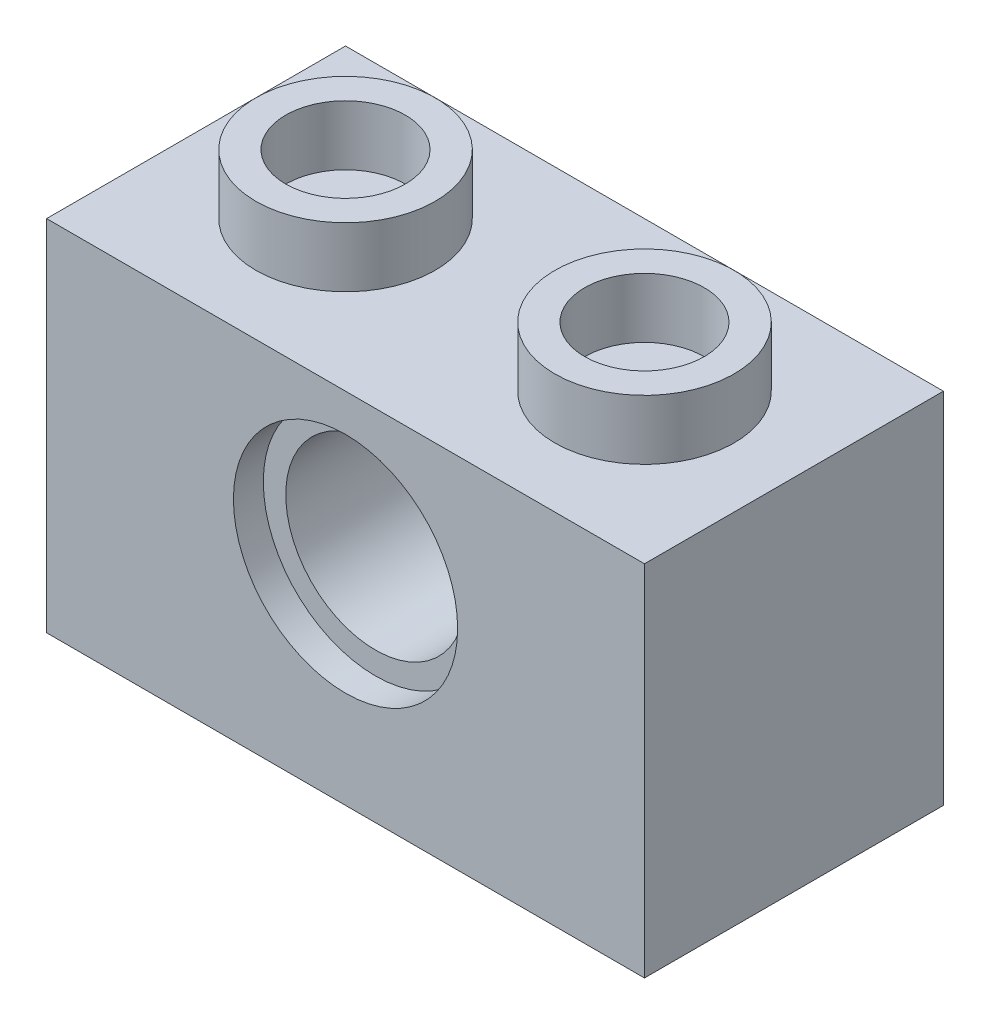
ISO-10303-21;
HEADER;
FILE_DESCRIPTION(('STEP AP214'),'2;1');
FILE_NAME('part.step','',(''),(''),'','','');
FILE_SCHEMA(('AUTOMOTIVE_DESIGN { 1 0 10303 214 1 1 1 1 }'));
ENDSEC;
DATA;
#1=APPLICATION_CONTEXT('core data for automotive mechanical design processes');
#2=APPLICATION_PROTOCOL_DEFINITION('international standard','automotive_design',2000,#1);
#3=PRODUCT_CONTEXT('',#1,'mechanical');
#4=PRODUCT('Part','Part','',(#3));
#5=PRODUCT_RELATED_PRODUCT_CATEGORY('part','',(#4));
#6=PRODUCT_DEFINITION_FORMATION('','',#4);
#7=PRODUCT_DEFINITION_CONTEXT('part definition',#1,'design');
#8=PRODUCT_DEFINITION('design','',#6,#7);
#9=PRODUCT_DEFINITION_SHAPE('','',#8);
#10=(LENGTH_UNIT() NAMED_UNIT(*) SI_UNIT(.MILLI.,.METRE.));
#11=(NAMED_UNIT(*) PLANE_ANGLE_UNIT() SI_UNIT($,.RADIAN.));
#12=(NAMED_UNIT(*) SI_UNIT($,.STERADIAN.) SOLID_ANGLE_UNIT());
#13=UNCERTAINTY_MEASURE_WITH_UNIT(LENGTH_MEASURE(1.E-05),#10,'distance_accuracy_value','');
#14=(GEOMETRIC_REPRESENTATION_CONTEXT(3) GLOBAL_UNCERTAINTY_ASSIGNED_CONTEXT((#13)) GLOBAL_UNIT_ASSIGNED_CONTEXT((#10,
#11,#12)) REPRESENTATION_CONTEXT('',''));
#15=CARTESIAN_POINT('',(0.,0.,0.));
#16=DIRECTION('',(0.,0.,1.));
#17=DIRECTION('',(1.,0.,0.));
#18=AXIS2_PLACEMENT_3D('',#15,#16,#17);
#19=CARTESIAN_POINT('',(0.,5.6,-4.));
#20=DIRECTION('',(0.,0.,1.));
#21=DIRECTION('',(1.,0.,0.));
#22=AXIS2_PLACEMENT_3D('',#19,#20,#21);
#23=CYLINDRICAL_SURFACE('',#22,2.4);
#24=CARTESIAN_POINT('',(0.,5.6,3.2));
#25=DIRECTION('',(0.,0.,1.));
#26=DIRECTION('',(1.,0.,0.));
#27=AXIS2_PLACEMENT_3D('',#24,#25,#26);
#28=CIRCLE('',#27,2.4);
#29=CARTESIAN_POINT('',(2.4,5.6,3.2));
#30=VERTEX_POINT('',#29);
#31=EDGE_CURVE('E164',#30,#30,#28,.F.);
#32=ORIENTED_EDGE('',*,*,#31,.F.);
#33=EDGE_LOOP('',(#32));
#34=FACE_BOUND('',#33,.T.);
#35=CARTESIAN_POINT('',(0.,5.6,-3.2));
#36=DIRECTION('',(0.,0.,-1.));
#37=DIRECTION('',(-1.,0.,0.));
#38=AXIS2_PLACEMENT_3D('',#35,#36,#37);
#39=CIRCLE('',#38,2.4);
#40=CARTESIAN_POINT('',(-2.4,5.6,-3.2));
#41=VERTEX_POINT('',#40);
#42=EDGE_CURVE('E228',#41,#41,#39,.F.);
#43=ORIENTED_EDGE('',*,*,#42,.F.);
#44=EDGE_LOOP('',(#43));
#45=FACE_BOUND('',#44,.T.);
#46=ADVANCED_FACE('F36',(#34,#45),#23,.F.);
#47=CARTESIAN_POINT('',(-8.,9.6,-4.));
#48=DIRECTION('',(-1.,0.,0.));
#49=DIRECTION('',(0.,-1.,0.));
#50=AXIS2_PLACEMENT_3D('',#47,#48,#49);
#51=PLANE('',#50);
#52=DIRECTION('',(0.,0.,1.));
#53=VECTOR('',#52,1.);
#54=CARTESIAN_POINT('',(-7.99999999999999,0.,-4.));
#55=LINE('',#54,#53);
#56=CARTESIAN_POINT('',(-7.99999999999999,0.,-4.));
#57=VERTEX_POINT('',#56);
#58=CARTESIAN_POINT('',(-7.99999999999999,0.,4.));
#59=VERTEX_POINT('',#58);
#60=EDGE_CURVE('E214',#57,#59,#55,.T.);
#61=ORIENTED_EDGE('',*,*,#60,.T.);
#62=DIRECTION('',(0.,-1.,0.));
#63=VECTOR('',#62,1.);
#64=CARTESIAN_POINT('',(-8.,9.6,4.));
#65=LINE('',#64,#63);
#66=CARTESIAN_POINT('',(-8.,9.6,4.));
#67=VERTEX_POINT('',#66);
#68=EDGE_CURVE('E189',#67,#59,#65,.T.);
#69=ORIENTED_EDGE('',*,*,#68,.F.);
#70=DIRECTION('',(0.,0.,1.));
#71=VECTOR('',#70,1.);
#72=CARTESIAN_POINT('',(-8.,9.6,-4.));
#73=LINE('',#72,#71);
#74=CARTESIAN_POINT('',(-8.,9.6,-4.));
#75=VERTEX_POINT('',#74);
#76=EDGE_CURVE('E64',#75,#67,#73,.T.);
#77=ORIENTED_EDGE('',*,*,#76,.F.);
#78=DIRECTION('',(0.,-1.,0.));
#79=VECTOR('',#78,1.);
#80=CARTESIAN_POINT('',(-8.,9.6,-4.));
#81=LINE('',#80,#79);
#82=EDGE_CURVE('E203',#75,#57,#81,.T.);
#83=ORIENTED_EDGE('',*,*,#82,.T.);
#84=EDGE_LOOP('',(#61,#69,#77,#83));
#85=FACE_BOUND('',#84,.T.);
#86=ADVANCED_FACE('F38',(#85),#51,.T.);
#87=CARTESIAN_POINT('',(-8.,9.6,-4.));
#88=DIRECTION('',(0.,1.,0.));
#89=DIRECTION('',(0.,0.,1.));
#90=AXIS2_PLACEMENT_3D('',#87,#88,#89);
#91=PLANE('',#90);
#92=CARTESIAN_POINT('',(4.,9.6,0.));
#93=DIRECTION('',(0.,1.,0.));
#94=DIRECTION('',(0.,0.,1.));
#95=AXIS2_PLACEMENT_3D('',#92,#93,#94);
#96=CIRCLE('',#95,2.4);
#97=CARTESIAN_POINT('',(4.,9.6,2.4));
#98=VERTEX_POINT('',#97);
#99=EDGE_CURVE('E176',#98,#98,#96,.T.);
#100=ORIENTED_EDGE('',*,*,#99,.F.);
#101=EDGE_LOOP('',(#100));
#102=FACE_BOUND('',#101,.T.);
#103=CARTESIAN_POINT('',(-4.,9.6,0.));
#104=DIRECTION('',(0.,1.,0.));
#105=DIRECTION('',(0.,0.,1.));
#106=AXIS2_PLACEMENT_3D('',#103,#104,#105);
#107=CIRCLE('',#106,2.4);
#108=CARTESIAN_POINT('',(-4.,9.6,2.4));
#109=VERTEX_POINT('',#108);
#110=EDGE_CURVE('E185',#109,#109,#107,.T.);
#111=ORIENTED_EDGE('',*,*,#110,.F.);
#112=EDGE_LOOP('',(#111));
#113=FACE_BOUND('',#112,.T.);
#114=ORIENTED_EDGE('',*,*,#76,.T.);
#115=DIRECTION('',(-1.,0.,0.));
#116=VECTOR('',#115,1.);
#117=CARTESIAN_POINT('',(-8.,9.6,4.));
#118=LINE('',#117,#116);
#119=CARTESIAN_POINT('',(8.,9.6,4.));
#120=VERTEX_POINT('',#119);
#121=EDGE_CURVE('E200',#120,#67,#118,.T.);
#122=ORIENTED_EDGE('',*,*,#121,.F.);
#123=DIRECTION('',(0.,0.,1.));
#124=VECTOR('',#123,1.);
#125=CARTESIAN_POINT('',(8.,9.6,-4.));
#126=LINE('',#125,#124);
#127=CARTESIAN_POINT('',(8.,9.6,-4.));
#128=VERTEX_POINT('',#127);
#129=EDGE_CURVE('E217',#128,#120,#126,.T.);
#130=ORIENTED_EDGE('',*,*,#129,.F.);
#131=DIRECTION('',(-1.,0.,0.));
#132=VECTOR('',#131,1.);
#133=CARTESIAN_POINT('',(-8.,9.6,-4.));
#134=LINE('',#133,#132);
#135=EDGE_CURVE('E211',#128,#75,#134,.T.);
#136=ORIENTED_EDGE('',*,*,#135,.T.);
#137=EDGE_LOOP('',(#114,#122,#130,#136));
#138=FACE_BOUND('',#137,.T.);
#139=ADVANCED_FACE('F285',(#102,#113,#138),#91,.T.);
#140=CARTESIAN_POINT('',(8.,9.6,-4.));
#141=DIRECTION('',(1.,0.,0.));
#142=DIRECTION('',(0.,0.,-1.));
#143=AXIS2_PLACEMENT_3D('',#140,#141,#142);
#144=PLANE('',#143);
#145=ORIENTED_EDGE('',*,*,#129,.T.);
#146=DIRECTION('',(0.,1.,0.));
#147=VECTOR('',#146,1.);
#148=CARTESIAN_POINT('',(8.,9.6,4.));
#149=LINE('',#148,#147);
#150=CARTESIAN_POINT('',(8.,0.,4.));
#151=VERTEX_POINT('',#150);
#152=EDGE_CURVE('E197',#151,#120,#149,.T.);
#153=ORIENTED_EDGE('',*,*,#152,.F.);
#154=DIRECTION('',(0.,0.,1.));
#155=VECTOR('',#154,1.);
#156=CARTESIAN_POINT('',(8.,0.,-4.));
#157=LINE('',#156,#155);
#158=CARTESIAN_POINT('',(8.,0.,-4.));
#159=VERTEX_POINT('',#158);
#160=EDGE_CURVE('E219',#159,#151,#157,.T.);
#161=ORIENTED_EDGE('',*,*,#160,.F.);
#162=DIRECTION('',(0.,1.,0.));
#163=VECTOR('',#162,1.);
#164=CARTESIAN_POINT('',(8.,9.6,-4.));
#165=LINE('',#164,#163);
#166=EDGE_CURVE('E208',#159,#128,#165,.T.);
#167=ORIENTED_EDGE('',*,*,#166,.T.);
#168=EDGE_LOOP('',(#145,#153,#161,#167));
#169=FACE_BOUND('',#168,.T.);
#170=ADVANCED_FACE('F326',(#169),#144,.T.);
#171=CARTESIAN_POINT('',(-7.99999999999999,0.,-4.));
#172=DIRECTION('',(0.,-1.,0.));
#173=DIRECTION('',(0.,0.,-1.));
#174=AXIS2_PLACEMENT_3D('',#171,#172,#173);
#175=PLANE('',#174);
#176=DIRECTION('',(0.,0.,1.));
#177=VECTOR('',#176,1.);
#178=CARTESIAN_POINT('',(6.4,0.,-4.));
#179=LINE('',#178,#177);
#180=CARTESIAN_POINT('',(6.4,0.,-2.4));
#181=VERTEX_POINT('',#180);
#182=CARTESIAN_POINT('',(6.4,0.,2.4));
#183=VERTEX_POINT('',#182);
#184=EDGE_CURVE('E151',#181,#183,#179,.T.);
#185=ORIENTED_EDGE('',*,*,#184,.F.);
#186=DIRECTION('',(1.,0.,0.));
#187=VECTOR('',#186,1.);
#188=CARTESIAN_POINT('',(0.,0.,-2.4));
#189=LINE('',#188,#187);
#190=CARTESIAN_POINT('',(-6.4,0.,-2.4));
#191=VERTEX_POINT('',#190);
#192=EDGE_CURVE('E143',#191,#181,#189,.T.);
#193=ORIENTED_EDGE('',*,*,#192,.F.);
#194=DIRECTION('',(0.,0.,1.));
#195=VECTOR('',#194,1.);
#196=CARTESIAN_POINT('',(-6.4,0.,-4.));
#197=LINE('',#196,#195);
#198=CARTESIAN_POINT('',(-6.4,0.,2.4));
#199=VERTEX_POINT('',#198);
#200=EDGE_CURVE('E127',#191,#199,#197,.T.);
#201=ORIENTED_EDGE('',*,*,#200,.T.);
#202=DIRECTION('',(1.,0.,0.));
#203=VECTOR('',#202,1.);
#204=CARTESIAN_POINT('',(0.,0.,2.4));
#205=LINE('',#204,#203);
#206=EDGE_CURVE('E156',#199,#183,#205,.T.);
#207=ORIENTED_EDGE('',*,*,#206,.T.);
#208=EDGE_LOOP('',(#185,#193,#201,#207));
#209=FACE_BOUND('',#208,.T.);
#210=ORIENTED_EDGE('',*,*,#160,.T.);
#211=DIRECTION('',(1.,0.,0.));
#212=VECTOR('',#211,1.);
#213=CARTESIAN_POINT('',(-7.99999999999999,0.,4.));
#214=LINE('',#213,#212);
#215=EDGE_CURVE('E194',#59,#151,#214,.T.);
#216=ORIENTED_EDGE('',*,*,#215,.F.);
#217=ORIENTED_EDGE('',*,*,#60,.F.);
#218=DIRECTION('',(1.,0.,0.));
#219=VECTOR('',#218,1.);
#220=CARTESIAN_POINT('',(-7.99999999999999,0.,-4.));
#221=LINE('',#220,#219);
#222=EDGE_CURVE('E205',#57,#159,#221,.T.);
#223=ORIENTED_EDGE('',*,*,#222,.T.);
#224=EDGE_LOOP('',(#210,#216,#217,#223));
#225=FACE_BOUND('',#224,.T.);
#226=ADVANCED_FACE('F256',(#209,#225),#175,.T.);
#227=CARTESIAN_POINT('',(0.,0.,-4.));
#228=DIRECTION('',(0.,0.,1.));
#229=DIRECTION('',(1.,0.,0.));
#230=AXIS2_PLACEMENT_3D('',#227,#228,#229);
#231=PLANE('',#230);
#232=CARTESIAN_POINT('',(0.,5.6,-4.));
#233=DIRECTION('',(0.,0.,1.));
#234=DIRECTION('',(1.,0.,0.));
#235=AXIS2_PLACEMENT_3D('',#232,#233,#234);
#236=CIRCLE('',#235,3.);
#237=CARTESIAN_POINT('',(3.,5.6,-4.));
#238=VERTEX_POINT('',#237);
#239=EDGE_CURVE('E237',#238,#238,#236,.T.);
#240=ORIENTED_EDGE('',*,*,#239,.T.);
#241=EDGE_LOOP('',(#240));
#242=FACE_BOUND('',#241,.T.);
#243=ORIENTED_EDGE('',*,*,#82,.F.);
#244=ORIENTED_EDGE('',*,*,#135,.F.);
#245=ORIENTED_EDGE('',*,*,#166,.F.);
#246=ORIENTED_EDGE('',*,*,#222,.F.);
#247=EDGE_LOOP('',(#243,#244,#245,#246));
#248=FACE_BOUND('',#247,.T.);
#249=ADVANCED_FACE('F319',(#242,#248),#231,.F.);
#250=CARTESIAN_POINT('',(0.,0.,4.));
#251=DIRECTION('',(0.,0.,1.));
#252=DIRECTION('',(1.,0.,0.));
#253=AXIS2_PLACEMENT_3D('',#250,#251,#252);
#254=PLANE('',#253);
#255=CARTESIAN_POINT('',(0.,5.6,4.));
#256=DIRECTION('',(0.,0.,1.));
#257=DIRECTION('',(1.,0.,0.));
#258=AXIS2_PLACEMENT_3D('',#255,#256,#257);
#259=CIRCLE('',#258,3.);
#260=CARTESIAN_POINT('',(3.,5.6,4.));
#261=VERTEX_POINT('',#260);
#262=EDGE_CURVE('E230',#261,#261,#259,.T.);
#263=ORIENTED_EDGE('',*,*,#262,.F.);
#264=EDGE_LOOP('',(#263));
#265=FACE_BOUND('',#264,.T.);
#266=ORIENTED_EDGE('',*,*,#68,.T.);
#267=ORIENTED_EDGE('',*,*,#215,.T.);
#268=ORIENTED_EDGE('',*,*,#152,.T.);
#269=ORIENTED_EDGE('',*,*,#121,.T.);
#270=EDGE_LOOP('',(#266,#267,#268,#269));
#271=FACE_BOUND('',#270,.T.);
#272=ADVANCED_FACE('F312',(#265,#271),#254,.T.);
#273=CARTESIAN_POINT('',(-4.,11.2,0.));
#274=DIRECTION('',(0.,1.,0.));
#275=DIRECTION('',(0.,0.,1.));
#276=AXIS2_PLACEMENT_3D('',#273,#274,#275);
#277=PLANE('',#276);
#278=CARTESIAN_POINT('',(-4.,11.2,0.));
#279=DIRECTION('',(0.,1.,0.));
#280=DIRECTION('',(0.,0.,1.));
#281=AXIS2_PLACEMENT_3D('',#278,#279,#280);
#282=CIRCLE('',#281,2.4);
#283=CARTESIAN_POINT('',(-4.,11.2,2.4));
#284=VERTEX_POINT('',#283);
#285=EDGE_CURVE('E186',#284,#284,#282,.T.);
#286=ORIENTED_EDGE('',*,*,#285,.T.);
#287=EDGE_LOOP('',(#286));
#288=FACE_BOUND('',#287,.T.);
#289=CARTESIAN_POINT('',(-4.,11.2,0.));
#290=DIRECTION('',(0.,1.,0.));
#291=DIRECTION('',(0.,0.,1.));
#292=AXIS2_PLACEMENT_3D('',#289,#290,#291);
#293=CIRCLE('',#292,1.6);
#294=CARTESIAN_POINT('',(-4.,11.2,1.6));
#295=VERTEX_POINT('',#294);
#296=EDGE_CURVE('E180',#295,#295,#293,.T.);
#297=ORIENTED_EDGE('',*,*,#296,.F.);
#298=EDGE_LOOP('',(#297));
#299=FACE_BOUND('',#298,.T.);
#300=ADVANCED_FACE('F309',(#288,#299),#277,.T.);
#301=CARTESIAN_POINT('',(-4.,11.2,0.));
#302=DIRECTION('',(0.,-1.,0.));
#303=DIRECTION('',(0.,0.,-1.));
#304=AXIS2_PLACEMENT_3D('',#301,#302,#303);
#305=CYLINDRICAL_SURFACE('',#304,2.4);
#306=ORIENTED_EDGE('',*,*,#285,.F.);
#307=EDGE_LOOP('',(#306));
#308=FACE_BOUND('',#307,.T.);
#309=ORIENTED_EDGE('',*,*,#110,.T.);
#310=EDGE_LOOP('',(#309));
#311=FACE_BOUND('',#310,.T.);
#312=ADVANCED_FACE('F307',(#308,#311),#305,.T.);
#313=CARTESIAN_POINT('',(-4.,11.2,0.));
#314=DIRECTION('',(0.,-1.,0.));
#315=DIRECTION('',(0.,0.,-1.));
#316=AXIS2_PLACEMENT_3D('',#313,#314,#315);
#317=CYLINDRICAL_SURFACE('',#316,1.6);
#318=ORIENTED_EDGE('',*,*,#296,.T.);
#319=EDGE_LOOP('',(#318));
#320=FACE_BOUND('',#319,.T.);
#321=CARTESIAN_POINT('',(-4.,9.6,0.));
#322=DIRECTION('',(0.,1.,0.));
#323=DIRECTION('',(0.,0.,1.));
#324=AXIS2_PLACEMENT_3D('',#321,#322,#323);
#325=CIRCLE('',#324,1.6);
#326=CARTESIAN_POINT('',(-4.,9.6,1.6));
#327=VERTEX_POINT('',#326);
#328=EDGE_CURVE('E216',#327,#327,#325,.F.);
#329=ORIENTED_EDGE('',*,*,#328,.T.);
#330=EDGE_LOOP('',(#329));
#331=FACE_BOUND('',#330,.T.);
#332=ADVANCED_FACE('F304',(#320,#331),#317,.F.);
#333=ORIENTED_EDGE('',*,*,#328,.F.);
#334=EDGE_LOOP('',(#333));
#335=FACE_BOUND('',#334,.T.);
#336=ADVANCED_FACE('F299',(#335),#91,.T.);
#337=CARTESIAN_POINT('',(4.,11.2,0.));
#338=DIRECTION('',(0.,1.,0.));
#339=DIRECTION('',(0.,0.,1.));
#340=AXIS2_PLACEMENT_3D('',#337,#338,#339);
#341=PLANE('',#340);
#342=CARTESIAN_POINT('',(4.,11.2,0.));
#343=DIRECTION('',(0.,1.,0.));
#344=DIRECTION('',(0.,0.,1.));
#345=AXIS2_PLACEMENT_3D('',#342,#343,#344);
#346=CIRCLE('',#345,2.4);
#347=CARTESIAN_POINT('',(4.,11.2,2.4));
#348=VERTEX_POINT('',#347);
#349=EDGE_CURVE('E177',#348,#348,#346,.T.);
#350=ORIENTED_EDGE('',*,*,#349,.T.);
#351=EDGE_LOOP('',(#350));
#352=FACE_BOUND('',#351,.T.);
#353=CARTESIAN_POINT('',(4.,11.2,0.));
#354=DIRECTION('',(0.,1.,0.));
#355=DIRECTION('',(0.,0.,1.));
#356=AXIS2_PLACEMENT_3D('',#353,#354,#355);
#357=CIRCLE('',#356,1.6);
#358=CARTESIAN_POINT('',(4.,11.2,1.6));
#359=VERTEX_POINT('',#358);
#360=EDGE_CURVE('E173',#359,#359,#357,.T.);
#361=ORIENTED_EDGE('',*,*,#360,.F.);
#362=EDGE_LOOP('',(#361));
#363=FACE_BOUND('',#362,.T.);
#364=ADVANCED_FACE('F296',(#352,#363),#341,.T.);
#365=CARTESIAN_POINT('',(4.,11.2,0.));
#366=DIRECTION('',(0.,-1.,0.));
#367=DIRECTION('',(0.,0.,-1.));
#368=AXIS2_PLACEMENT_3D('',#365,#366,#367);
#369=CYLINDRICAL_SURFACE('',#368,2.4);
#370=ORIENTED_EDGE('',*,*,#349,.F.);
#371=EDGE_LOOP('',(#370));
#372=FACE_BOUND('',#371,.T.);
#373=ORIENTED_EDGE('',*,*,#99,.T.);
#374=EDGE_LOOP('',(#373));
#375=FACE_BOUND('',#374,.T.);
#376=ADVANCED_FACE('F294',(#372,#375),#369,.T.);
#377=CARTESIAN_POINT('',(4.,11.2,0.));
#378=DIRECTION('',(0.,-1.,0.));
#379=DIRECTION('',(0.,0.,-1.));
#380=AXIS2_PLACEMENT_3D('',#377,#378,#379);
#381=CYLINDRICAL_SURFACE('',#380,1.6);
#382=ORIENTED_EDGE('',*,*,#360,.T.);
#383=EDGE_LOOP('',(#382));
#384=FACE_BOUND('',#383,.T.);
#385=CARTESIAN_POINT('',(4.,9.6,0.));
#386=DIRECTION('',(0.,1.,0.));
#387=DIRECTION('',(0.,0.,1.));
#388=AXIS2_PLACEMENT_3D('',#385,#386,#387);
#389=CIRCLE('',#388,1.6);
#390=CARTESIAN_POINT('',(4.,9.6,1.6));
#391=VERTEX_POINT('',#390);
#392=EDGE_CURVE('E49',#391,#391,#389,.F.);
#393=ORIENTED_EDGE('',*,*,#392,.T.);
#394=EDGE_LOOP('',(#393));
#395=FACE_BOUND('',#394,.T.);
#396=ADVANCED_FACE('F290',(#384,#395),#381,.F.);
#397=ORIENTED_EDGE('',*,*,#392,.F.);
#398=EDGE_LOOP('',(#397));
#399=FACE_BOUND('',#398,.T.);
#400=ADVANCED_FACE('F293',(#399),#91,.T.);
#401=CARTESIAN_POINT('',(-8.,8.,-4.));
#402=DIRECTION('',(0.,1.,0.));
#403=DIRECTION('',(0.,0.,1.));
#404=AXIS2_PLACEMENT_3D('',#401,#402,#403);
#405=PLANE('',#404);
#406=DIRECTION('',(-1.,0.,0.));
#407=VECTOR('',#406,1.);
#408=CARTESIAN_POINT('',(0.,8.,-2.4));
#409=LINE('',#408,#407);
#410=CARTESIAN_POINT('',(6.4,8.,-2.4));
#411=VERTEX_POINT('',#410);
#412=CARTESIAN_POINT('',(3.2,8.,-2.4));
#413=VERTEX_POINT('',#412);
#414=EDGE_CURVE('E128',#411,#413,#409,.T.);
#415=ORIENTED_EDGE('',*,*,#414,.F.);
#416=DIRECTION('',(0.,0.,1.));
#417=VECTOR('',#416,1.);
#418=CARTESIAN_POINT('',(6.4,8.,-4.));
#419=LINE('',#418,#417);
#420=CARTESIAN_POINT('',(6.4,8.,2.4));
#421=VERTEX_POINT('',#420);
#422=EDGE_CURVE('E138',#411,#421,#419,.T.);
#423=ORIENTED_EDGE('',*,*,#422,.T.);
#424=DIRECTION('',(-1.,0.,0.));
#425=VECTOR('',#424,1.);
#426=CARTESIAN_POINT('',(0.,8.,2.4));
#427=LINE('',#426,#425);
#428=CARTESIAN_POINT('',(3.2,8.,2.4));
#429=VERTEX_POINT('',#428);
#430=EDGE_CURVE('E144',#421,#429,#427,.T.);
#431=ORIENTED_EDGE('',*,*,#430,.T.);
#432=DIRECTION('',(0.,0.,1.));
#433=VECTOR('',#432,1.);
#434=CARTESIAN_POINT('',(3.2,8.,-4.));
#435=LINE('',#434,#433);
#436=EDGE_CURVE('E170',#413,#429,#435,.T.);
#437=ORIENTED_EDGE('',*,*,#436,.F.);
#438=EDGE_LOOP('',(#415,#423,#431,#437));
#439=FACE_BOUND('',#438,.T.);
#440=ADVANCED_FACE('F264',(#439),#405,.F.);
#441=CARTESIAN_POINT('',(-6.4,9.6,-4.));
#442=DIRECTION('',(-1.,0.,0.));
#443=DIRECTION('',(0.,-1.,0.));
#444=AXIS2_PLACEMENT_3D('',#441,#442,#443);
#445=PLANE('',#444);
#446=ORIENTED_EDGE('',*,*,#200,.F.);
#447=DIRECTION('',(0.,-1.,0.));
#448=VECTOR('',#447,1.);
#449=CARTESIAN_POINT('',(-6.4,0.,-2.4));
#450=LINE('',#449,#448);
#451=CARTESIAN_POINT('',(-6.4,8.,-2.4));
#452=VERTEX_POINT('',#451);
#453=EDGE_CURVE('E56',#452,#191,#450,.T.);
#454=ORIENTED_EDGE('',*,*,#453,.F.);
#455=DIRECTION('',(0.,0.,1.));
#456=VECTOR('',#455,1.);
#457=CARTESIAN_POINT('',(-6.4,8.,-4.));
#458=LINE('',#457,#456);
#459=CARTESIAN_POINT('',(-6.4,8.,2.4));
#460=VERTEX_POINT('',#459);
#461=EDGE_CURVE('E131',#452,#460,#458,.T.);
#462=ORIENTED_EDGE('',*,*,#461,.T.);
#463=DIRECTION('',(0.,-1.,0.));
#464=VECTOR('',#463,1.);
#465=CARTESIAN_POINT('',(-6.4,0.,2.4));
#466=LINE('',#465,#464);
#467=EDGE_CURVE('E160',#460,#199,#466,.T.);
#468=ORIENTED_EDGE('',*,*,#467,.T.);
#469=EDGE_LOOP('',(#446,#454,#462,#468));
#470=FACE_BOUND('',#469,.T.);
#471=ADVANCED_FACE('F140',(#470),#445,.F.);
#472=ORIENTED_EDGE('',*,*,#461,.F.);
#473=CARTESIAN_POINT('',(-3.2,8.,-2.4));
#474=VERTEX_POINT('',#473);
#475=EDGE_CURVE('E119',#474,#452,#409,.T.);
#476=ORIENTED_EDGE('',*,*,#475,.F.);
#477=DIRECTION('',(0.,0.,1.));
#478=VECTOR('',#477,1.);
#479=CARTESIAN_POINT('',(-3.2,8.,-4.));
#480=LINE('',#479,#478);
#481=CARTESIAN_POINT('',(-3.2,8.,2.4));
#482=VERTEX_POINT('',#481);
#483=EDGE_CURVE('E137',#474,#482,#480,.T.);
#484=ORIENTED_EDGE('',*,*,#483,.T.);
#485=EDGE_CURVE('E133',#482,#460,#427,.T.);
#486=ORIENTED_EDGE('',*,*,#485,.T.);
#487=EDGE_LOOP('',(#472,#476,#484,#486));
#488=FACE_BOUND('',#487,.T.);
#489=ADVANCED_FACE('F132',(#488),#405,.F.);
#490=CARTESIAN_POINT('',(6.4,9.6,-4.));
#491=DIRECTION('',(1.,0.,0.));
#492=DIRECTION('',(0.,0.,-1.));
#493=AXIS2_PLACEMENT_3D('',#490,#491,#492);
#494=PLANE('',#493);
#495=ORIENTED_EDGE('',*,*,#422,.F.);
#496=DIRECTION('',(0.,1.,0.));
#497=VECTOR('',#496,1.);
#498=CARTESIAN_POINT('',(6.4,0.,-2.4));
#499=LINE('',#498,#497);
#500=EDGE_CURVE('E146',#181,#411,#499,.T.);
#501=ORIENTED_EDGE('',*,*,#500,.F.);
#502=ORIENTED_EDGE('',*,*,#184,.T.);
#503=DIRECTION('',(0.,1.,0.));
#504=VECTOR('',#503,1.);
#505=CARTESIAN_POINT('',(6.4,0.,2.4));
#506=LINE('',#505,#504);
#507=EDGE_CURVE('E153',#183,#421,#506,.T.);
#508=ORIENTED_EDGE('',*,*,#507,.T.);
#509=EDGE_LOOP('',(#495,#501,#502,#508));
#510=FACE_BOUND('',#509,.T.);
#511=ADVANCED_FACE('F260',(#510),#494,.F.);
#512=CARTESIAN_POINT('',(0.,0.,-2.4));
#513=DIRECTION('',(0.,0.,1.));
#514=DIRECTION('',(1.,0.,0.));
#515=AXIS2_PLACEMENT_3D('',#512,#513,#514);
#516=PLANE('',#515);
#517=ORIENTED_EDGE('',*,*,#475,.T.);
#518=ORIENTED_EDGE('',*,*,#453,.T.);
#519=ORIENTED_EDGE('',*,*,#192,.T.);
#520=ORIENTED_EDGE('',*,*,#500,.T.);
#521=ORIENTED_EDGE('',*,*,#414,.T.);
#522=CARTESIAN_POINT('',(0.,5.6,-2.4));
#523=DIRECTION('',(0.,0.,1.));
#524=DIRECTION('',(1.,0.,0.));
#525=AXIS2_PLACEMENT_3D('',#522,#523,#524);
#526=CIRCLE('',#525,4.);
#527=EDGE_CURVE('E124',#474,#413,#526,.T.);
#528=ORIENTED_EDGE('',*,*,#527,.F.);
#529=EDGE_LOOP('',(#517,#518,#519,#520,#521,#528));
#530=FACE_BOUND('',#529,.T.);
#531=ADVANCED_FACE('F121',(#530),#516,.T.);
#532=CARTESIAN_POINT('',(0.,0.,2.4));
#533=DIRECTION('',(0.,0.,1.));
#534=DIRECTION('',(1.,0.,0.));
#535=AXIS2_PLACEMENT_3D('',#532,#533,#534);
#536=PLANE('',#535);
#537=ORIENTED_EDGE('',*,*,#467,.F.);
#538=ORIENTED_EDGE('',*,*,#485,.F.);
#539=CARTESIAN_POINT('',(0.,5.6,2.4));
#540=DIRECTION('',(0.,0.,1.));
#541=DIRECTION('',(1.,0.,0.));
#542=AXIS2_PLACEMENT_3D('',#539,#540,#541);
#543=CIRCLE('',#542,4.);
#544=EDGE_CURVE('E161',#482,#429,#543,.T.);
#545=ORIENTED_EDGE('',*,*,#544,.T.);
#546=ORIENTED_EDGE('',*,*,#430,.F.);
#547=ORIENTED_EDGE('',*,*,#507,.F.);
#548=ORIENTED_EDGE('',*,*,#206,.F.);
#549=EDGE_LOOP('',(#537,#538,#545,#546,#547,#548));
#550=FACE_BOUND('',#549,.T.);
#551=ADVANCED_FACE('F268',(#550),#536,.F.);
#552=CARTESIAN_POINT('',(0.,5.6,-4.));
#553=DIRECTION('',(0.,0.,1.));
#554=DIRECTION('',(1.,0.,0.));
#555=AXIS2_PLACEMENT_3D('',#552,#553,#554);
#556=CYLINDRICAL_SURFACE('',#555,4.);
#557=CARTESIAN_POINT('',(0.,1.6,-1.6));
#558=CARTESIAN_POINT('',(0.085994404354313,1.60000583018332,-1.59999211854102));
#559=CARTESIAN_POINT('',(0.172138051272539,1.60280564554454,-1.5930257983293));
#560=CARTESIAN_POINT('',(0.341997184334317,1.61373237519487,-1.56540183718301));
#561=CARTESIAN_POINT('',(0.425705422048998,1.62187377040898,-1.54470697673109));
#562=CARTESIAN_POINT('',(0.587963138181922,1.64260632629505,-1.49049913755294));
#563=CARTESIAN_POINT('',(0.666528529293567,1.65518290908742,-1.45702812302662));
#564=CARTESIAN_POINT('',(0.816857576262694,1.68354711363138,-1.37838466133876));
#565=CARTESIAN_POINT('',(0.888623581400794,1.69933362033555,-1.33321627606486));
#566=CARTESIAN_POINT('',(1.02680080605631,1.73335291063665,-1.23021160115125));
#567=CARTESIAN_POINT('',(1.09284981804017,1.75166162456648,-1.17191467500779));
#568=CARTESIAN_POINT('',(1.21454000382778,1.78831538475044,-1.04527999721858));
#569=CARTESIAN_POINT('',(1.27017608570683,1.80666044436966,-0.976937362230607));
#570=CARTESIAN_POINT('',(1.3718996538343,1.84221766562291,-0.828457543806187));
#571=CARTESIAN_POINT('',(1.41745198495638,1.85934307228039,-0.747930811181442));
#572=CARTESIAN_POINT('',(1.49420377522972,1.88933082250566,-0.579570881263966));
#573=CARTESIAN_POINT('',(1.52541005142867,1.90219519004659,-0.491741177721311));
#574=CARTESIAN_POINT('',(1.57111905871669,1.92138913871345,-0.315430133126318));
#575=CARTESIAN_POINT('',(1.58631517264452,1.92798863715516,-0.227159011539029));
#576=CARTESIAN_POINT('',(1.60173836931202,1.93468796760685,-0.0490920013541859));
#577=CARTESIAN_POINT('',(1.60197281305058,1.93479099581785,0.040703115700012));
#578=CARTESIAN_POINT('',(1.58799149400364,1.92871599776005,0.212605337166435));
#579=CARTESIAN_POINT('',(1.57478025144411,1.9229745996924,0.294812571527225));
#580=CARTESIAN_POINT('',(1.53595750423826,1.90659049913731,0.455727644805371));
#581=CARTESIAN_POINT('',(1.5103438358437,1.89594694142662,0.534434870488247));
#582=CARTESIAN_POINT('',(1.44695578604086,1.87072411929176,0.688014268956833));
#583=CARTESIAN_POINT('',(1.40894388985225,1.8560689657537,0.762775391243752));
#584=CARTESIAN_POINT('',(1.32200516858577,1.82449506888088,0.905132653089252));
#585=CARTESIAN_POINT('',(1.27307424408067,1.80757547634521,0.972726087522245));
#586=CARTESIAN_POINT('',(1.16124047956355,1.77178610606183,1.1043277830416));
#587=CARTESIAN_POINT('',(1.09754997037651,1.75286668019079,1.16765498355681));
#588=CARTESIAN_POINT('',(0.960251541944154,1.71632140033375,1.28294758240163));
#589=CARTESIAN_POINT('',(0.886641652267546,1.6986958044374,1.33491071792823));
#590=CARTESIAN_POINT('',(0.729662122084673,1.66628254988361,1.42689395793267));
#591=CARTESIAN_POINT('',(0.646128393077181,1.65155783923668,1.46665782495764));
#592=CARTESIAN_POINT('',(0.472819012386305,1.62708137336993,1.53133428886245));
#593=CARTESIAN_POINT('',(0.383046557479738,1.61732709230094,1.55625443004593));
#594=CARTESIAN_POINT('',(0.205516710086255,1.60435088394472,1.58915863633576));
#595=CARTESIAN_POINT('',(0.117954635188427,1.60077643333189,1.59805796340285));
#596=CARTESIAN_POINT('',(-0.0574762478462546,1.59945217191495,1.60137048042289));
#597=CARTESIAN_POINT('',(-0.14534497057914,1.60170085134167,1.59578742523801));
#598=CARTESIAN_POINT('',(-0.314746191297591,1.61153946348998,1.57096659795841));
#599=CARTESIAN_POINT('',(-0.396385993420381,1.61888486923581,1.55235361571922));
#600=CARTESIAN_POINT('',(-0.555308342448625,1.637924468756,1.50285143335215));
#601=CARTESIAN_POINT('',(-0.632590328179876,1.64961922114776,1.47196065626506));
#602=CARTESIAN_POINT('',(-0.783263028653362,1.67666724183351,1.39777204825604));
#603=CARTESIAN_POINT('',(-0.856462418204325,1.69212147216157,1.35412362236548));
#604=CARTESIAN_POINT('',(-0.994754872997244,1.7250130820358,1.25604774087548));
#605=CARTESIAN_POINT('',(-1.0598446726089,1.74245125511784,1.20161596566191));
#606=CARTESIAN_POINT('',(-1.18457843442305,1.77883905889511,1.0793039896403));
#607=CARTESIAN_POINT('',(-1.24357914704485,1.79781246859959,1.01077316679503));
#608=CARTESIAN_POINT('',(-1.34940095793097,1.83406661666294,0.864447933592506));
#609=CARTESIAN_POINT('',(-1.39622004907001,1.85134707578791,0.786651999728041));
#610=CARTESIAN_POINT('',(-1.4766460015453,1.88228560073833,0.622830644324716));
#611=CARTESIAN_POINT('',(-1.51012047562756,1.8959069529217,0.536732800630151));
#612=CARTESIAN_POINT('',(-1.56183697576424,1.91741061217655,0.359413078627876));
#613=CARTESIAN_POINT('',(-1.58009024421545,1.92529715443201,0.26819503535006));
#614=CARTESIAN_POINT('',(-1.59977249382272,1.93382592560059,0.0902976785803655));
#615=CARTESIAN_POINT('',(-1.60231766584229,1.93494863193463,0.00376412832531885));
#616=CARTESIAN_POINT('',(-1.59344252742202,1.93108131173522,-0.168435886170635));
#617=CARTESIAN_POINT('',(-1.58202399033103,1.92609206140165,-0.254102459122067));
#618=CARTESIAN_POINT('',(-1.54645709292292,1.91098680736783,-0.418665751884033));
#619=CARTESIAN_POINT('',(-1.52282999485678,1.90108134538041,-0.497696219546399));
#620=CARTESIAN_POINT('',(-1.46400435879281,1.87740799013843,-0.650702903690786));
#621=CARTESIAN_POINT('',(-1.42880262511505,1.86363903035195,-0.724677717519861));
#622=CARTESIAN_POINT('',(-1.34549821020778,1.83281112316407,-0.870087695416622));
#623=CARTESIAN_POINT('',(-1.29677226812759,1.81560894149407,-0.941134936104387));
#624=CARTESIAN_POINT('',(-1.1887136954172,1.7802895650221,-1.074394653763));
#625=CARTESIAN_POINT('',(-1.1293778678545,1.76217209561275,-1.13660445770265));
#626=CARTESIAN_POINT('',(-0.99720440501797,1.72565146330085,-1.25456228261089));
#627=CARTESIAN_POINT('',(-0.923740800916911,1.70730593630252,-1.30962984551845));
#628=CARTESIAN_POINT('',(-0.767920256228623,1.67359674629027,-1.40666963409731));
#629=CARTESIAN_POINT('',(-0.68555920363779,1.65823447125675,-1.44863576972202));
#630=CARTESIAN_POINT('',(-0.515790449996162,1.63248228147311,-1.51729777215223));
#631=CARTESIAN_POINT('',(-0.428505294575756,1.62200509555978,-1.54426345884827));
#632=CARTESIAN_POINT('',(-0.250301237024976,1.60684555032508,-1.58291129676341));
#633=CARTESIAN_POINT('',(-0.15939482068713,1.6021448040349,-1.59464194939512));
#634=CARTESIAN_POINT('',(-0.0455298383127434,1.60019280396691,-1.59951630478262));
#635=CARTESIAN_POINT('',(-0.0227701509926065,1.59999845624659,-1.60000208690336));
#636=CARTESIAN_POINT('',(0.,1.6,-1.6));
#637=B_SPLINE_CURVE_WITH_KNOTS('',3,(#557,#558,#559,#560,#561,#562,#563,#564,#565,#566,#567,
#568,#569,#570,#571,#572,#573,#574,#575,#576,#577,#578,#579,#580,#581,#582,#583,#584,#585,#586,
#587,#588,#589,#590,#591,#592,#593,#594,#595,#596,#597,#598,#599,#600,#601,#602,#603,#604,#605,
#606,#607,#608,#609,#610,#611,#612,#613,#614,#615,#616,#617,#618,#619,#620,#621,#622,#623,#624,
#625,#626,#627,#628,#629,#630,#631,#632,#633,#634,#635,#636),.UNSPECIFIED.,.T.,.F.,(4,2,2,2,2,2,
2,2,2,2,2,2,2,2,2,2,2,2,2,2,2,2,2,2,2,2,2,2,2,2,2,2,2,2,2,2,2,2,2,4),(0.,0.257922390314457,
0.516546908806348,0.774329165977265,1.03202202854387,1.30077905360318,1.56966715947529,
1.85052207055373,2.13124338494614,2.39923284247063,2.6670904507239,2.91630662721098,
3.16556629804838,3.41991301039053,3.67435537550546,3.94846679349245,4.22263274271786,
4.50221530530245,4.78165564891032,5.04455347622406,5.30738314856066,5.55840364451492,
5.80945639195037,6.0681881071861,6.32702367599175,6.60294779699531,6.87891735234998,
7.15756036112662,7.43599738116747,7.69439738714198,7.95276458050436,8.20091454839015,
8.44913308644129,8.71156374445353,8.97407361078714,9.25360338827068,9.53326290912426,
9.80771440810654,10.0812900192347,10.1495843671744),.UNSPECIFIED.);
#638=CARTESIAN_POINT('',(0.,1.6,-1.6));
#639=VERTEX_POINT('',#638);
#640=EDGE_CURVE('E11',#639,#639,#637,.T.);
#641=ORIENTED_EDGE('',*,*,#640,.F.);
#642=EDGE_LOOP('',(#641));
#643=FACE_BOUND('',#642,.T.);
#644=ORIENTED_EDGE('',*,*,#436,.T.);
#645=ORIENTED_EDGE('',*,*,#544,.F.);
#646=ORIENTED_EDGE('',*,*,#483,.F.);
#647=ORIENTED_EDGE('',*,*,#527,.T.);
#648=EDGE_LOOP('',(#644,#645,#646,#647));
#649=FACE_BOUND('',#648,.T.);
#650=ADVANCED_FACE('F267',(#643,#649),#556,.T.);
#651=CARTESIAN_POINT('',(0.,5.6,3.2));
#652=DIRECTION('',(0.,0.,1.));
#653=DIRECTION('',(1.,0.,0.));
#654=AXIS2_PLACEMENT_3D('',#651,#652,#653);
#655=PLANE('',#654);
#656=CARTESIAN_POINT('',(0.,5.6,3.2));
#657=DIRECTION('',(0.,0.,1.));
#658=DIRECTION('',(1.,0.,0.));
#659=AXIS2_PLACEMENT_3D('',#656,#657,#658);
#660=CIRCLE('',#659,3.);
#661=CARTESIAN_POINT('',(3.,5.6,3.2));
#662=VERTEX_POINT('',#661);
#663=EDGE_CURVE('E227',#662,#662,#660,.T.);
#664=ORIENTED_EDGE('',*,*,#663,.T.);
#665=EDGE_LOOP('',(#664));
#666=FACE_BOUND('',#665,.T.);
#667=ORIENTED_EDGE('',*,*,#31,.T.);
#668=EDGE_LOOP('',(#667));
#669=FACE_BOUND('',#668,.T.);
#670=ADVANCED_FACE('F275',(#666,#669),#655,.T.);
#671=CARTESIAN_POINT('',(0.,5.6,3.2));
#672=DIRECTION('',(0.,0.,1.));
#673=DIRECTION('',(1.,0.,0.));
#674=AXIS2_PLACEMENT_3D('',#671,#672,#673);
#675=CYLINDRICAL_SURFACE('',#674,3.);
#676=ORIENTED_EDGE('',*,*,#663,.F.);
#677=EDGE_LOOP('',(#676));
#678=FACE_BOUND('',#677,.T.);
#679=ORIENTED_EDGE('',*,*,#262,.T.);
#680=EDGE_LOOP('',(#679));
#681=FACE_BOUND('',#680,.T.);
#682=ADVANCED_FACE('F431',(#678,#681),#675,.F.);
#683=CARTESIAN_POINT('',(0.,5.6,-3.2));
#684=DIRECTION('',(0.,0.,-1.));
#685=DIRECTION('',(1.,0.,0.));
#686=AXIS2_PLACEMENT_3D('',#683,#684,#685);
#687=PLANE('',#686);
#688=CARTESIAN_POINT('',(0.,5.6,-3.2));
#689=DIRECTION('',(0.,0.,1.));
#690=DIRECTION('',(1.,0.,0.));
#691=AXIS2_PLACEMENT_3D('',#688,#689,#690);
#692=CIRCLE('',#691,3.);
#693=CARTESIAN_POINT('',(3.,5.6,-3.2));
#694=VERTEX_POINT('',#693);
#695=EDGE_CURVE('E231',#694,#694,#692,.T.);
#696=ORIENTED_EDGE('',*,*,#695,.F.);
#697=EDGE_LOOP('',(#696));
#698=FACE_BOUND('',#697,.T.);
#699=ORIENTED_EDGE('',*,*,#42,.T.);
#700=EDGE_LOOP('',(#699));
#701=FACE_BOUND('',#700,.T.);
#702=ADVANCED_FACE('F440',(#698,#701),#687,.T.);
#703=CARTESIAN_POINT('',(0.,5.6,-3.2));
#704=DIRECTION('',(0.,0.,-1.));
#705=DIRECTION('',(-1.,0.,0.));
#706=AXIS2_PLACEMENT_3D('',#703,#704,#705);
#707=CYLINDRICAL_SURFACE('',#706,3.);
#708=ORIENTED_EDGE('',*,*,#695,.T.);
#709=EDGE_LOOP('',(#708));
#710=FACE_BOUND('',#709,.T.);
#711=ORIENTED_EDGE('',*,*,#239,.F.);
#712=EDGE_LOOP('',(#711));
#713=FACE_BOUND('',#712,.T.);
#714=ADVANCED_FACE('F452',(#710,#713),#707,.F.);
#715=CARTESIAN_POINT('',(0.,11.201,0.));
#716=DIRECTION('',(0.,-1.,0.));
#717=DIRECTION('',(0.,0.,-1.));
#718=AXIS2_PLACEMENT_3D('',#715,#716,#717);
#719=CYLINDRICAL_SURFACE('',#718,1.6);
#720=ORIENTED_EDGE('',*,*,#640,.T.);
#721=EDGE_LOOP('',(#720));
#722=FACE_BOUND('',#721,.T.);
#723=CARTESIAN_POINT('',(0.,0.,0.));
#724=DIRECTION('',(0.,-1.,0.));
#725=DIRECTION('',(0.,0.,-1.));
#726=AXIS2_PLACEMENT_3D('',#723,#724,#725);
#727=CIRCLE('',#726,1.6);
#728=CARTESIAN_POINT('',(0.,0.,-1.6));
#729=VERTEX_POINT('',#728);
#730=EDGE_CURVE('E510',#729,#729,#727,.T.);
#731=ORIENTED_EDGE('',*,*,#730,.F.);
#732=EDGE_LOOP('',(#731));
#733=FACE_BOUND('',#732,.T.);
#734=ADVANCED_FACE('F460',(#722,#733),#719,.T.);
#735=CARTESIAN_POINT('',(0.,0.,0.));
#736=DIRECTION('',(0.,-1.,0.));
#737=DIRECTION('',(0.,0.,-1.));
#738=AXIS2_PLACEMENT_3D('',#735,#736,#737);
#739=PLANE('',#738);
#740=CARTESIAN_POINT('',(0.,0.,0.));
#741=DIRECTION('',(0.,-1.,0.));
#742=DIRECTION('',(0.,0.,-1.));
#743=AXIS2_PLACEMENT_3D('',#740,#741,#742);
#744=CIRCLE('',#743,0.8);
#745=CARTESIAN_POINT('',(0.,0.,-0.8));
#746=VERTEX_POINT('',#745);
#747=EDGE_CURVE('E509',#746,#746,#744,.T.);
#748=ORIENTED_EDGE('',*,*,#747,.F.);
#749=EDGE_LOOP('',(#748));
#750=FACE_BOUND('',#749,.T.);
#751=ORIENTED_EDGE('',*,*,#730,.T.);
#752=EDGE_LOOP('',(#751));
#753=FACE_BOUND('',#752,.T.);
#754=ADVANCED_FACE('F476',(#750,#753),#739,.T.);
#755=CARTESIAN_POINT('',(0.,11.201,0.));
#756=DIRECTION('',(0.,-1.,0.));
#757=DIRECTION('',(0.,0.,-1.));
#758=AXIS2_PLACEMENT_3D('',#755,#756,#757);
#759=CYLINDRICAL_SURFACE('',#758,0.8);
#760=CARTESIAN_POINT('',(0.,1.6,-0.8));
#761=CARTESIAN_POINT('',(-0.0444615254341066,1.60000081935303,-0.799998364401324));
#762=CARTESIAN_POINT('',(-0.0889437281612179,1.60074891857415,-0.796280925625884));
#763=CARTESIAN_POINT('',(-0.176650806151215,1.60366107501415,-0.781521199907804));
#764=CARTESIAN_POINT('',(-0.219874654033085,1.60582625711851,-0.770473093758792));
#765=CARTESIAN_POINT('',(-0.30378424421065,1.61133080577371,-0.741406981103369));
#766=CARTESIAN_POINT('',(-0.344472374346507,1.61466904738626,-0.72339565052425));
#767=CARTESIAN_POINT('',(-0.42224639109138,1.62215681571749,-0.680934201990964));
#768=CARTESIAN_POINT('',(-0.459332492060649,1.62630629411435,-0.656484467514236));
#769=CARTESIAN_POINT('',(-0.529354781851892,1.63502267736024,-0.601489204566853));
#770=CARTESIAN_POINT('',(-0.56223516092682,1.63959403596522,-0.570873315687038));
#771=CARTESIAN_POINT('',(-0.622429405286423,1.64860655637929,-0.504566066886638));
#772=CARTESIAN_POINT('',(-0.64974283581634,1.65304770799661,-0.468874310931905));
#773=CARTESIAN_POINT('',(-0.698265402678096,1.66134046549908,-0.3930270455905));
#774=CARTESIAN_POINT('',(-0.719416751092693,1.66518634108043,-0.352833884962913));
#775=CARTESIAN_POINT('',(-0.754644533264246,1.67178985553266,-0.269374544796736));
#776=CARTESIAN_POINT('',(-0.76872166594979,1.67454760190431,-0.226108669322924));
#777=CARTESIAN_POINT('',(-0.789220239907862,1.67861755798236,-0.138332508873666));
#778=CARTESIAN_POINT('',(-0.795739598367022,1.6799482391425,-0.093845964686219));
#779=CARTESIAN_POINT('',(-0.801241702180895,1.68106899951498,-0.00439214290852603));
#780=CARTESIAN_POINT('',(-0.8002252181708,1.68085923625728,0.0405750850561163));
#781=CARTESIAN_POINT('',(-0.790763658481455,1.67893959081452,0.128997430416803));
#782=CARTESIAN_POINT('',(-0.782430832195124,1.67725237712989,0.172465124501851));
#783=CARTESIAN_POINT('',(-0.758750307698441,1.67260363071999,0.257372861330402));
#784=CARTESIAN_POINT('',(-0.743402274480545,1.66964203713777,0.298812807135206));
#785=CARTESIAN_POINT('',(-0.706019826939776,1.66275505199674,0.378812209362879));
#786=CARTESIAN_POINT('',(-0.683940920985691,1.65882328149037,0.417350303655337));
#787=CARTESIAN_POINT('',(-0.633754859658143,1.65044304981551,0.490216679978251));
#788=CARTESIAN_POINT('',(-0.605647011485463,1.64599452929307,0.524544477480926));
#789=CARTESIAN_POINT('',(-0.543599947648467,1.63698383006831,0.588663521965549));
#790=CARTESIAN_POINT('',(-0.509564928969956,1.63242104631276,0.618362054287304));
#791=CARTESIAN_POINT('',(-0.436948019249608,1.62376921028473,0.671643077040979));
#792=CARTESIAN_POINT('',(-0.398366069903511,1.61968016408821,0.695225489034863));
#793=CARTESIAN_POINT('',(-0.317647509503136,1.6124264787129,0.73562200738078));
#794=CARTESIAN_POINT('',(-0.27550545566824,1.60926328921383,0.75242551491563));
#795=CARTESIAN_POINT('',(-0.188919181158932,1.60422872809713,0.778688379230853));
#796=CARTESIAN_POINT('',(-0.144475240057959,1.60235719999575,0.788148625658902));
#797=CARTESIAN_POINT('',(-0.0553435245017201,1.60013862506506,0.799325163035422));
#798=CARTESIAN_POINT('',(-0.0106722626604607,1.59976660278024,0.801168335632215));
#799=CARTESIAN_POINT('',(0.0783399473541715,1.60051958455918,0.797400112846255));
#800=CARTESIAN_POINT('',(0.122680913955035,1.60164450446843,0.791789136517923));
#801=CARTESIAN_POINT('',(0.209364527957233,1.60524934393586,0.773377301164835));
#802=CARTESIAN_POINT('',(0.251721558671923,1.60771698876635,0.760641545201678));
#803=CARTESIAN_POINT('',(0.333698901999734,1.61373158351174,0.728412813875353));
#804=CARTESIAN_POINT('',(0.373319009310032,1.61727861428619,0.708919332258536));
#805=CARTESIAN_POINT('',(0.449232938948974,1.62512070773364,0.66345400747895));
#806=CARTESIAN_POINT('',(0.48548010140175,1.62942439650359,0.637405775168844));
#807=CARTESIAN_POINT('',(0.553134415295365,1.63828212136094,0.579672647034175));
#808=CARTESIAN_POINT('',(0.58454104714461,1.6428361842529,0.547987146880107));
#809=CARTESIAN_POINT('',(0.642112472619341,1.65176557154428,0.479301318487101));
#810=CARTESIAN_POINT('',(0.668190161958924,1.65613711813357,0.44222740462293));
#811=CARTESIAN_POINT('',(0.713748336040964,1.66412646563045,0.364150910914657));
#812=CARTESIAN_POINT('',(0.733229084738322,1.66774429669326,0.323148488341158));
#813=CARTESIAN_POINT('',(0.764921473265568,1.67378607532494,0.238585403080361));
#814=CARTESIAN_POINT('',(0.77717079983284,1.67621620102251,0.195039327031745));
#815=CARTESIAN_POINT('',(0.794166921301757,1.6796205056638,0.106453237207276));
#816=CARTESIAN_POINT('',(0.79891469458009,1.68059487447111,0.0614134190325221));
#817=CARTESIAN_POINT('',(0.800736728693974,1.68096680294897,-0.028007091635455));
#818=CARTESIAN_POINT('',(0.797948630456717,1.68039264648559,-0.0723849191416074));
#819=CARTESIAN_POINT('',(0.785081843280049,1.67779541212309,-0.160025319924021));
#820=CARTESIAN_POINT('',(0.775003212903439,1.67577234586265,-0.203287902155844));
#821=CARTESIAN_POINT('',(0.747902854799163,1.67051788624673,-0.287382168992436));
#822=CARTESIAN_POINT('',(0.730898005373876,1.66728943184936,-0.328219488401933));
#823=CARTESIAN_POINT('',(0.690443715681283,1.65998628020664,-0.406482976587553));
#824=CARTESIAN_POINT('',(0.666993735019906,1.65591151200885,-0.44390885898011));
#825=CARTESIAN_POINT('',(0.613844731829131,1.6472883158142,-0.514972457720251));
#826=CARTESIAN_POINT('',(0.584046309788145,1.6427330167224,-0.548535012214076));
#827=CARTESIAN_POINT('',(0.519251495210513,1.63371134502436,-0.610228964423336));
#828=CARTESIAN_POINT('',(0.484253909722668,1.62924499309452,-0.638359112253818));
#829=CARTESIAN_POINT('',(0.409614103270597,1.62084934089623,-0.688667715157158));
#830=CARTESIAN_POINT('',(0.369927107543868,1.61692615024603,-0.71078080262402));
#831=CARTESIAN_POINT('',(0.287333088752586,1.61011899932,-0.747988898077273));
#832=CARTESIAN_POINT('',(0.244429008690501,1.60723410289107,-0.763090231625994));
#833=CARTESIAN_POINT('',(0.167857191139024,1.60338901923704,-0.782921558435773));
#834=CARTESIAN_POINT('',(0.134625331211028,1.60212557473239,-0.789314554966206));
#835=CARTESIAN_POINT('',(0.0675996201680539,1.60043076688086,-0.797854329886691));
#836=CARTESIAN_POINT('',(0.0338057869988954,1.59999937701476,-0.800001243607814));
#837=CARTESIAN_POINT('',(0.,1.6,-0.8));
#838=B_SPLINE_CURVE_WITH_KNOTS('',3,(#760,#761,#762,#763,#764,#765,#766,#767,#768,#769,#770,
#771,#772,#773,#774,#775,#776,#777,#778,#779,#780,#781,#782,#783,#784,#785,#786,#787,#788,#789,
#790,#791,#792,#793,#794,#795,#796,#797,#798,#799,#800,#801,#802,#803,#804,#805,#806,#807,#808,
#809,#810,#811,#812,#813,#814,#815,#816,#817,#818,#819,#820,#821,#822,#823,#824,#825,#826,#827,
#828,#829,#830,#831,#832,#833,#834,#835,#836,#837),.UNSPECIFIED.,.T.,.F.,(4,2,2,2,2,2,2,2,2,2,2,
2,2,2,2,2,2,2,2,2,2,2,2,2,2,2,2,2,2,2,2,2,2,2,2,2,2,2,4),(0.,0.133260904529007,
0.266627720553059,0.399866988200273,0.53309832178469,0.667946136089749,0.802804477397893,
0.938889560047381,1.07496119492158,1.2092494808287,1.3435240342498,1.47577381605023,
1.60802991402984,1.74117992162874,1.87434523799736,2.0099060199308,2.14546854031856,
2.28124219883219,2.41699940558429,2.55048588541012,2.68396486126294,2.81624363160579,
2.94853231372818,3.08244052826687,3.21636310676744,3.35232502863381,3.48828150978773,
3.62352304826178,3.75874694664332,3.89151778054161,4.02428754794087,4.15673569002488,
4.28919494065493,4.42390460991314,4.55864523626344,4.69479597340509,4.83082364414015,
4.93215020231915,5.03347353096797),.UNSPECIFIED.);
#839=CARTESIAN_POINT('',(0.,1.6,-0.8));
#840=VERTEX_POINT('',#839);
#841=EDGE_CURVE('E242',#840,#840,#838,.T.);
#842=ORIENTED_EDGE('',*,*,#841,.T.);
#843=EDGE_LOOP('',(#842));
#844=FACE_BOUND('',#843,.T.);
#845=ORIENTED_EDGE('',*,*,#747,.T.);
#846=EDGE_LOOP('',(#845));
#847=FACE_BOUND('',#846,.T.);
#848=ADVANCED_FACE('F468',(#844,#847),#759,.F.);
#849=ORIENTED_EDGE('',*,*,#841,.F.);
#850=EDGE_LOOP('',(#849));
#851=FACE_BOUND('',#850,.T.);
#852=ADVANCED_FACE('F277',(#851),#556,.T.);
#853=CLOSED_SHELL('',(#46,#86,#139,#170,#226,#249,#272,#300,#312,#332,#336,#364,#376,#396,#400,
#440,#471,#489,#511,#531,#551,#650,#670,#682,#702,#714,#734,#754,#848,#852));
#854=MANIFOLD_SOLID_BREP('B2',#853);
#855=ADVANCED_BREP_SHAPE_REPRESENTATION('',(#18,#854),#14);
#856=SHAPE_DEFINITION_REPRESENTATION(#9,#855);
ENDSEC;
END-ISO-10303-21;
